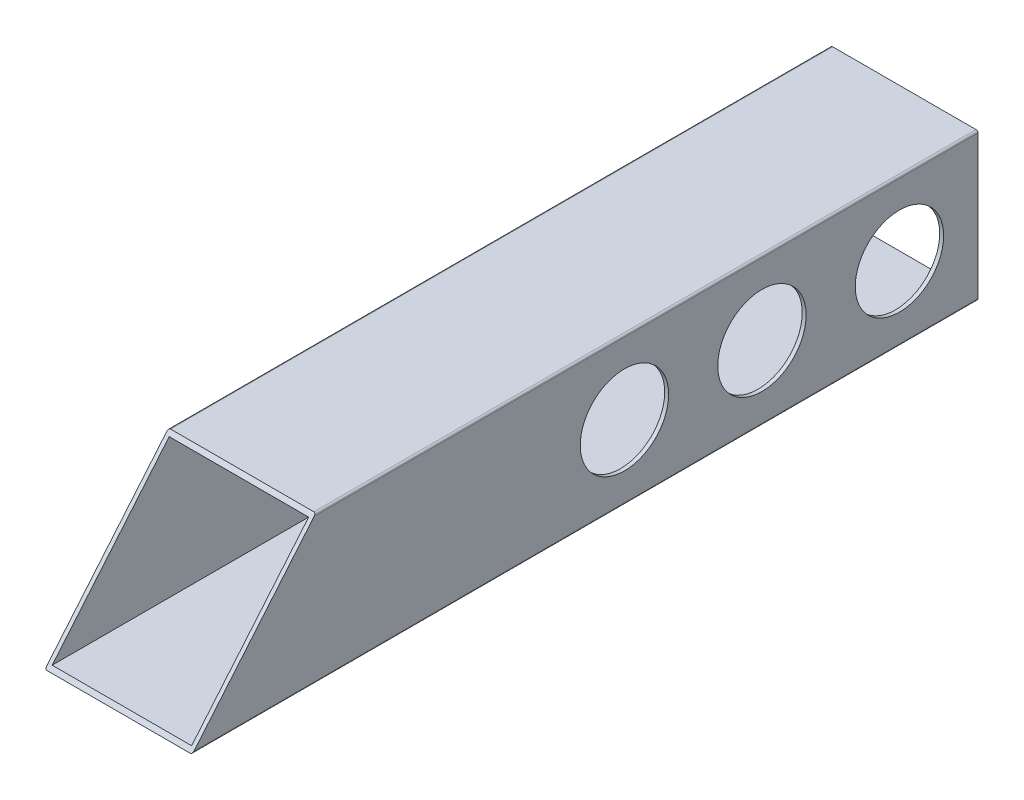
ISO-10303-21;
HEADER;
FILE_DESCRIPTION(('STEP AP214'),'2;1');
FILE_NAME('part.step','',(''),(''),'','','');
FILE_SCHEMA(('AUTOMOTIVE_DESIGN { 1 0 10303 214 1 1 1 1 }'));
ENDSEC;
DATA;
#1=APPLICATION_CONTEXT('core data for automotive mechanical design processes');
#2=APPLICATION_PROTOCOL_DEFINITION('international standard','automotive_design',2000,#1);
#3=PRODUCT_CONTEXT('',#1,'mechanical');
#4=PRODUCT('Part','Part','',(#3));
#5=PRODUCT_RELATED_PRODUCT_CATEGORY('part','',(#4));
#6=PRODUCT_DEFINITION_FORMATION('','',#4);
#7=PRODUCT_DEFINITION_CONTEXT('part definition',#1,'design');
#8=PRODUCT_DEFINITION('design','',#6,#7);
#9=PRODUCT_DEFINITION_SHAPE('','',#8);
#10=(LENGTH_UNIT() NAMED_UNIT(*) SI_UNIT(.MILLI.,.METRE.));
#11=(NAMED_UNIT(*) PLANE_ANGLE_UNIT() SI_UNIT($,.RADIAN.));
#12=(NAMED_UNIT(*) SI_UNIT($,.STERADIAN.) SOLID_ANGLE_UNIT());
#13=UNCERTAINTY_MEASURE_WITH_UNIT(LENGTH_MEASURE(1.E-05),#10,'distance_accuracy_value','');
#14=(GEOMETRIC_REPRESENTATION_CONTEXT(3) GLOBAL_UNCERTAINTY_ASSIGNED_CONTEXT((#13)) GLOBAL_UNIT_ASSIGNED_CONTEXT((#10,
#11,#12)) REPRESENTATION_CONTEXT('',''));
#15=CARTESIAN_POINT('',(0.,0.,0.));
#16=DIRECTION('',(0.,0.,1.));
#17=DIRECTION('',(1.,0.,0.));
#18=AXIS2_PLACEMENT_3D('',#15,#16,#17);
#19=CARTESIAN_POINT('',(148.,1.99999999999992,0.));
#20=DIRECTION('',(0.,0.,-1.));
#21=DIRECTION('',(-1.,0.,0.));
#22=AXIS2_PLACEMENT_3D('',#19,#20,#21);
#23=PLANE('',#22);
#24=CARTESIAN_POINT('',(148.,1.99999999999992,0.));
#25=DIRECTION('',(0.,0.,1.));
#26=DIRECTION('',(-1.,0.,0.));
#27=AXIS2_PLACEMENT_3D('',#24,#25,#26);
#28=CIRCLE('',#27,2.);
#29=CARTESIAN_POINT('',(148.,0.,0.));
#30=VERTEX_POINT('',#29);
#31=CARTESIAN_POINT('',(150.,1.99999999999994,0.));
#32=VERTEX_POINT('',#31);
#33=EDGE_CURVE('E148',#30,#32,#28,.T.);
#34=ORIENTED_EDGE('',*,*,#33,.F.);
#35=DIRECTION('',(1.,0.,0.));
#36=VECTOR('',#35,1.);
#37=CARTESIAN_POINT('',(148.,0.,0.));
#38=LINE('',#37,#36);
#39=CARTESIAN_POINT('',(2.00000000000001,0.,0.));
#40=VERTEX_POINT('',#39);
#41=EDGE_CURVE('E220',#40,#30,#38,.T.);
#42=ORIENTED_EDGE('',*,*,#41,.F.);
#43=CARTESIAN_POINT('',(2.,2.,0.));
#44=DIRECTION('',(0.,0.,1.));
#45=DIRECTION('',(1.,0.,0.));
#46=AXIS2_PLACEMENT_3D('',#43,#44,#45);
#47=CIRCLE('',#46,2.);
#48=CARTESIAN_POINT('',(0.,2.00000000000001,0.));
#49=VERTEX_POINT('',#48);
#50=EDGE_CURVE('E236',#49,#40,#47,.T.);
#51=ORIENTED_EDGE('',*,*,#50,.F.);
#52=DIRECTION('',(0.,-1.,0.));
#53=VECTOR('',#52,1.);
#54=CARTESIAN_POINT('',(0.,2.00000000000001,0.));
#55=LINE('',#54,#53);
#56=CARTESIAN_POINT('',(0.,148.,0.));
#57=VERTEX_POINT('',#56);
#58=EDGE_CURVE('E233',#57,#49,#55,.T.);
#59=ORIENTED_EDGE('',*,*,#58,.F.);
#60=CARTESIAN_POINT('',(2.,148.,0.));
#61=DIRECTION('',(0.,0.,1.));
#62=DIRECTION('',(-1.,0.,0.));
#63=AXIS2_PLACEMENT_3D('',#60,#61,#62);
#64=CIRCLE('',#63,2.);
#65=CARTESIAN_POINT('',(2.00000000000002,150.,0.));
#66=VERTEX_POINT('',#65);
#67=EDGE_CURVE('E230',#66,#57,#64,.T.);
#68=ORIENTED_EDGE('',*,*,#67,.F.);
#69=DIRECTION('',(-1.,0.,0.));
#70=VECTOR('',#69,1.);
#71=CARTESIAN_POINT('',(2.00000000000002,150.,0.));
#72=LINE('',#71,#70);
#73=CARTESIAN_POINT('',(148.,150.,0.));
#74=VERTEX_POINT('',#73);
#75=EDGE_CURVE('E227',#74,#66,#72,.T.);
#76=ORIENTED_EDGE('',*,*,#75,.F.);
#77=CARTESIAN_POINT('',(148.,148.,0.));
#78=DIRECTION('',(0.,0.,1.));
#79=DIRECTION('',(-1.,0.,0.));
#80=AXIS2_PLACEMENT_3D('',#77,#78,#79);
#81=CIRCLE('',#80,2.);
#82=CARTESIAN_POINT('',(150.,148.,0.));
#83=VERTEX_POINT('',#82);
#84=EDGE_CURVE('E224',#83,#74,#81,.T.);
#85=ORIENTED_EDGE('',*,*,#84,.F.);
#86=DIRECTION('',(0.,1.,0.));
#87=VECTOR('',#86,1.);
#88=CARTESIAN_POINT('',(150.,148.,0.));
#89=LINE('',#88,#87);
#90=EDGE_CURVE('E222',#32,#83,#89,.T.);
#91=ORIENTED_EDGE('',*,*,#90,.F.);
#92=EDGE_LOOP('',(#34,#42,#51,#59,#68,#76,#85,#91));
#93=FACE_BOUND('',#92,.T.);
#94=DIRECTION('',(-1.,0.,0.));
#95=VECTOR('',#94,1.);
#96=CARTESIAN_POINT('',(4.,146.,0.));
#97=LINE('',#96,#95);
#98=CARTESIAN_POINT('',(146.,146.,0.));
#99=VERTEX_POINT('',#98);
#100=CARTESIAN_POINT('',(4.,146.,0.));
#101=VERTEX_POINT('',#100);
#102=EDGE_CURVE('E208',#99,#101,#97,.T.);
#103=ORIENTED_EDGE('',*,*,#102,.T.);
#104=DIRECTION('',(0.,-1.,0.));
#105=VECTOR('',#104,1.);
#106=CARTESIAN_POINT('',(4.,3.99999999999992,0.));
#107=LINE('',#106,#105);
#108=CARTESIAN_POINT('',(4.,3.99999999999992,0.));
#109=VERTEX_POINT('',#108);
#110=EDGE_CURVE('E134',#101,#109,#107,.T.);
#111=ORIENTED_EDGE('',*,*,#110,.T.);
#112=DIRECTION('',(1.,0.,0.));
#113=VECTOR('',#112,1.);
#114=CARTESIAN_POINT('',(146.,3.99999999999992,0.));
#115=LINE('',#114,#113);
#116=CARTESIAN_POINT('',(146.,3.99999999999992,0.));
#117=VERTEX_POINT('',#116);
#118=EDGE_CURVE('E202',#109,#117,#115,.T.);
#119=ORIENTED_EDGE('',*,*,#118,.T.);
#120=DIRECTION('',(0.,1.,0.));
#121=VECTOR('',#120,1.);
#122=CARTESIAN_POINT('',(146.,146.,0.));
#123=LINE('',#122,#121);
#124=EDGE_CURVE('E205',#117,#99,#123,.T.);
#125=ORIENTED_EDGE('',*,*,#124,.T.);
#126=EDGE_LOOP('',(#103,#111,#119,#125));
#127=FACE_BOUND('',#126,.T.);
#128=ADVANCED_FACE('F33',(#93,#127),#23,.T.);
#129=CARTESIAN_POINT('',(148.,1.99999999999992,800.));
#130=DIRECTION('',(0.,0.,-1.));
#131=DIRECTION('',(-1.,0.,0.));
#132=AXIS2_PLACEMENT_3D('',#129,#130,#131);
#133=CYLINDRICAL_SURFACE('',#132,2.);
#134=DIRECTION('',(0.,0.,-1.));
#135=VECTOR('',#134,1.);
#136=CARTESIAN_POINT('',(150.,1.99999999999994,800.));
#137=LINE('',#136,#135);
#138=CARTESIAN_POINT('',(150.,1.99999999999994,798.321800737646));
#139=VERTEX_POINT('',#138);
#140=EDGE_CURVE('E42',#139,#32,#137,.T.);
#141=ORIENTED_EDGE('',*,*,#140,.F.);
#142=CARTESIAN_POINT('',(148.,1.99999999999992,798.321800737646));
#143=DIRECTION('',(0.,-0.642787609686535,-0.766044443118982));
#144=DIRECTION('',(0.,0.766044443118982,-0.642787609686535));
#145=AXIS2_PLACEMENT_3D('',#142,#143,#144);
#146=ELLIPSE('',#145,2.61081457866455,2.);
#147=CARTESIAN_POINT('',(148.,0.,800.));
#148=VERTEX_POINT('',#147);
#149=EDGE_CURVE('E123',#139,#148,#146,.T.);
#150=ORIENTED_EDGE('',*,*,#149,.T.);
#151=DIRECTION('',(0.,0.,-1.));
#152=VECTOR('',#151,1.);
#153=CARTESIAN_POINT('',(148.,0.,800.));
#154=LINE('',#153,#152);
#155=EDGE_CURVE('E219',#148,#30,#154,.T.);
#156=ORIENTED_EDGE('',*,*,#155,.T.);
#157=ORIENTED_EDGE('',*,*,#33,.T.);
#158=EDGE_LOOP('',(#141,#150,#156,#157));
#159=FACE_BOUND('',#158,.T.);
#160=ADVANCED_FACE('F35',(#159),#133,.T.);
#161=CARTESIAN_POINT('',(150.,148.,800.));
#162=DIRECTION('',(-1.,0.,0.));
#163=DIRECTION('',(0.,0.,1.));
#164=AXIS2_PLACEMENT_3D('',#161,#162,#163);
#165=PLANE('',#164);
#166=CARTESIAN_POINT('',(150.,74.9999999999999,360.));
#167=DIRECTION('',(1.,0.,0.));
#168=DIRECTION('',(0.,0.,-1.));
#169=AXIS2_PLACEMENT_3D('',#166,#167,#168);
#170=CIRCLE('',#169,45.);
#171=CARTESIAN_POINT('',(150.,74.9999999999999,315.));
#172=VERTEX_POINT('',#171);
#173=EDGE_CURVE('E326',#172,#172,#170,.T.);
#174=ORIENTED_EDGE('',*,*,#173,.F.);
#175=EDGE_LOOP('',(#174));
#176=FACE_BOUND('',#175,.T.);
#177=CARTESIAN_POINT('',(150.,74.9999999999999,220.));
#178=DIRECTION('',(1.,0.,0.));
#179=DIRECTION('',(0.,0.,-1.));
#180=AXIS2_PLACEMENT_3D('',#177,#178,#179);
#181=CIRCLE('',#180,45.);
#182=CARTESIAN_POINT('',(150.,74.9999999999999,175.));
#183=VERTEX_POINT('',#182);
#184=EDGE_CURVE('E167',#183,#183,#181,.T.);
#185=ORIENTED_EDGE('',*,*,#184,.F.);
#186=EDGE_LOOP('',(#185));
#187=FACE_BOUND('',#186,.T.);
#188=CARTESIAN_POINT('',(150.,74.9999999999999,80.));
#189=DIRECTION('',(1.,0.,0.));
#190=DIRECTION('',(0.,0.,-1.));
#191=AXIS2_PLACEMENT_3D('',#188,#189,#190);
#192=CIRCLE('',#191,45.);
#193=CARTESIAN_POINT('',(150.,74.9999999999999,35.));
#194=VERTEX_POINT('',#193);
#195=EDGE_CURVE('E164',#194,#194,#192,.T.);
#196=ORIENTED_EDGE('',*,*,#195,.F.);
#197=EDGE_LOOP('',(#196));
#198=FACE_BOUND('',#197,.T.);
#199=DIRECTION('',(0.,0.,-1.));
#200=VECTOR('',#199,1.);
#201=CARTESIAN_POINT('',(150.,148.,800.));
#202=LINE('',#201,#200);
#203=CARTESIAN_POINT('',(150.,148.,675.813254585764));
#204=VERTEX_POINT('',#203);
#205=EDGE_CURVE('E142',#204,#83,#202,.T.);
#206=ORIENTED_EDGE('',*,*,#205,.F.);
#207=DIRECTION('',(0.,0.766044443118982,-0.642787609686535));
#208=VECTOR('',#207,1.);
#209=CARTESIAN_POINT('',(150.,0.,800.));
#210=LINE('',#209,#208);
#211=EDGE_CURVE('E126',#139,#204,#210,.T.);
#212=ORIENTED_EDGE('',*,*,#211,.F.);
#213=ORIENTED_EDGE('',*,*,#140,.T.);
#214=ORIENTED_EDGE('',*,*,#90,.T.);
#215=EDGE_LOOP('',(#206,#212,#213,#214));
#216=FACE_BOUND('',#215,.T.);
#217=ADVANCED_FACE('F139',(#176,#187,#198,#216),#165,.F.);
#218=CARTESIAN_POINT('',(148.,148.,800.));
#219=DIRECTION('',(0.,0.,-1.));
#220=DIRECTION('',(-1.,0.,0.));
#221=AXIS2_PLACEMENT_3D('',#218,#219,#220);
#222=CYLINDRICAL_SURFACE('',#221,2.);
#223=DIRECTION('',(0.,0.,-1.));
#224=VECTOR('',#223,1.);
#225=CARTESIAN_POINT('',(148.,150.,800.));
#226=LINE('',#225,#224);
#227=CARTESIAN_POINT('',(148.,150.,674.13505532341));
#228=VERTEX_POINT('',#227);
#229=EDGE_CURVE('E150',#228,#74,#226,.T.);
#230=ORIENTED_EDGE('',*,*,#229,.F.);
#231=CARTESIAN_POINT('',(148.,148.,675.813254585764));
#232=DIRECTION('',(0.,-0.642787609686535,-0.766044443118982));
#233=DIRECTION('',(0.,0.766044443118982,-0.642787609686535));
#234=AXIS2_PLACEMENT_3D('',#231,#232,#233);
#235=ELLIPSE('',#234,2.61081457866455,2.);
#236=EDGE_CURVE('E135',#228,#204,#235,.T.);
#237=ORIENTED_EDGE('',*,*,#236,.T.);
#238=ORIENTED_EDGE('',*,*,#205,.T.);
#239=ORIENTED_EDGE('',*,*,#84,.T.);
#240=EDGE_LOOP('',(#230,#237,#238,#239));
#241=FACE_BOUND('',#240,.T.);
#242=ADVANCED_FACE('F256',(#241),#222,.T.);
#243=CARTESIAN_POINT('',(2.00000000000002,150.,800.));
#244=DIRECTION('',(0.,-1.,0.));
#245=DIRECTION('',(1.,0.,0.));
#246=AXIS2_PLACEMENT_3D('',#243,#244,#245);
#247=PLANE('',#246);
#248=DIRECTION('',(0.,0.,-1.));
#249=VECTOR('',#248,1.);
#250=CARTESIAN_POINT('',(2.00000000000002,150.,800.));
#251=LINE('',#250,#249);
#252=CARTESIAN_POINT('',(2.,150.,674.135055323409));
#253=VERTEX_POINT('',#252);
#254=EDGE_CURVE('E247',#253,#66,#251,.T.);
#255=ORIENTED_EDGE('',*,*,#254,.F.);
#256=DIRECTION('',(1.,0.,0.));
#257=VECTOR('',#256,1.);
#258=CARTESIAN_POINT('',(0.,150.,674.13505532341));
#259=LINE('',#258,#257);
#260=EDGE_CURVE('E184',#253,#228,#259,.T.);
#261=ORIENTED_EDGE('',*,*,#260,.T.);
#262=ORIENTED_EDGE('',*,*,#229,.T.);
#263=ORIENTED_EDGE('',*,*,#75,.T.);
#264=EDGE_LOOP('',(#255,#261,#262,#263));
#265=FACE_BOUND('',#264,.T.);
#266=ADVANCED_FACE('F251',(#265),#247,.F.);
#267=CARTESIAN_POINT('',(2.,148.,800.));
#268=DIRECTION('',(0.,0.,-1.));
#269=DIRECTION('',(-1.,0.,0.));
#270=AXIS2_PLACEMENT_3D('',#267,#268,#269);
#271=CYLINDRICAL_SURFACE('',#270,2.);
#272=DIRECTION('',(0.,0.,-1.));
#273=VECTOR('',#272,1.);
#274=CARTESIAN_POINT('',(0.,148.,800.));
#275=LINE('',#274,#273);
#276=CARTESIAN_POINT('',(0.,148.,675.813254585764));
#277=VERTEX_POINT('',#276);
#278=EDGE_CURVE('E245',#277,#57,#275,.T.);
#279=ORIENTED_EDGE('',*,*,#278,.F.);
#280=CARTESIAN_POINT('',(2.,148.,675.813254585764));
#281=DIRECTION('',(0.,-0.642787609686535,-0.766044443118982));
#282=DIRECTION('',(0.,0.766044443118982,-0.642787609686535));
#283=AXIS2_PLACEMENT_3D('',#280,#281,#282);
#284=ELLIPSE('',#283,2.61081457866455,2.);
#285=EDGE_CURVE('E196',#277,#253,#284,.T.);
#286=ORIENTED_EDGE('',*,*,#285,.T.);
#287=ORIENTED_EDGE('',*,*,#254,.T.);
#288=ORIENTED_EDGE('',*,*,#67,.T.);
#289=EDGE_LOOP('',(#279,#286,#287,#288));
#290=FACE_BOUND('',#289,.T.);
#291=ADVANCED_FACE('F263',(#290),#271,.T.);
#292=CARTESIAN_POINT('',(0.,2.00000000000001,800.));
#293=DIRECTION('',(1.,0.,0.));
#294=DIRECTION('',(0.,0.,-1.));
#295=AXIS2_PLACEMENT_3D('',#292,#293,#294);
#296=PLANE('',#295);
#297=CARTESIAN_POINT('',(0.,74.9999999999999,360.));
#298=DIRECTION('',(1.,0.,0.));
#299=DIRECTION('',(0.,0.,-1.));
#300=AXIS2_PLACEMENT_3D('',#297,#298,#299);
#301=CIRCLE('',#300,45.);
#302=CARTESIAN_POINT('',(0.,74.9999999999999,315.));
#303=VERTEX_POINT('',#302);
#304=EDGE_CURVE('E328',#303,#303,#301,.T.);
#305=ORIENTED_EDGE('',*,*,#304,.T.);
#306=EDGE_LOOP('',(#305));
#307=FACE_BOUND('',#306,.T.);
#308=CARTESIAN_POINT('',(0.,74.9999999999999,220.));
#309=DIRECTION('',(1.,0.,0.));
#310=DIRECTION('',(0.,0.,-1.));
#311=AXIS2_PLACEMENT_3D('',#308,#309,#310);
#312=CIRCLE('',#311,45.);
#313=CARTESIAN_POINT('',(0.,74.9999999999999,175.));
#314=VERTEX_POINT('',#313);
#315=EDGE_CURVE('E160',#314,#314,#312,.T.);
#316=ORIENTED_EDGE('',*,*,#315,.T.);
#317=EDGE_LOOP('',(#316));
#318=FACE_BOUND('',#317,.T.);
#319=CARTESIAN_POINT('',(0.,74.9999999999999,80.));
#320=DIRECTION('',(1.,0.,0.));
#321=DIRECTION('',(0.,0.,-1.));
#322=AXIS2_PLACEMENT_3D('',#319,#320,#321);
#323=CIRCLE('',#322,45.);
#324=CARTESIAN_POINT('',(0.,74.9999999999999,35.));
#325=VERTEX_POINT('',#324);
#326=EDGE_CURVE('E156',#325,#325,#323,.T.);
#327=ORIENTED_EDGE('',*,*,#326,.T.);
#328=EDGE_LOOP('',(#327));
#329=FACE_BOUND('',#328,.T.);
#330=DIRECTION('',(0.,0.,-1.));
#331=VECTOR('',#330,1.);
#332=CARTESIAN_POINT('',(0.,2.00000000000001,800.));
#333=LINE('',#332,#331);
#334=CARTESIAN_POINT('',(0.,2.,798.321800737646));
#335=VERTEX_POINT('',#334);
#336=EDGE_CURVE('E243',#335,#49,#333,.T.);
#337=ORIENTED_EDGE('',*,*,#336,.F.);
#338=DIRECTION('',(0.,0.766044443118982,-0.642787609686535));
#339=VECTOR('',#338,1.);
#340=CARTESIAN_POINT('',(0.,0.,800.));
#341=LINE('',#340,#339);
#342=EDGE_CURVE('E143',#335,#277,#341,.T.);
#343=ORIENTED_EDGE('',*,*,#342,.T.);
#344=ORIENTED_EDGE('',*,*,#278,.T.);
#345=ORIENTED_EDGE('',*,*,#58,.T.);
#346=EDGE_LOOP('',(#337,#343,#344,#345));
#347=FACE_BOUND('',#346,.T.);
#348=ADVANCED_FACE('F266',(#307,#318,#329,#347),#296,.F.);
#349=CARTESIAN_POINT('',(2.,2.,800.));
#350=DIRECTION('',(0.,0.,-1.));
#351=DIRECTION('',(-1.,0.,0.));
#352=AXIS2_PLACEMENT_3D('',#349,#350,#351);
#353=CYLINDRICAL_SURFACE('',#352,2.);
#354=DIRECTION('',(0.,0.,-1.));
#355=VECTOR('',#354,1.);
#356=CARTESIAN_POINT('',(2.00000000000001,0.,800.));
#357=LINE('',#356,#355);
#358=CARTESIAN_POINT('',(2.00000000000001,0.,800.));
#359=VERTEX_POINT('',#358);
#360=EDGE_CURVE('E240',#359,#40,#357,.T.);
#361=ORIENTED_EDGE('',*,*,#360,.F.);
#362=CARTESIAN_POINT('',(2.,2.,798.321800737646));
#363=DIRECTION('',(0.,-0.642787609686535,-0.766044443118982));
#364=DIRECTION('',(0.,0.766044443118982,-0.642787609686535));
#365=AXIS2_PLACEMENT_3D('',#362,#363,#364);
#366=ELLIPSE('',#365,2.61081457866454,2.);
#367=EDGE_CURVE('E193',#359,#335,#366,.T.);
#368=ORIENTED_EDGE('',*,*,#367,.T.);
#369=ORIENTED_EDGE('',*,*,#336,.T.);
#370=ORIENTED_EDGE('',*,*,#50,.T.);
#371=EDGE_LOOP('',(#361,#368,#369,#370));
#372=FACE_BOUND('',#371,.T.);
#373=ADVANCED_FACE('F269',(#372),#353,.T.);
#374=CARTESIAN_POINT('',(148.,0.,800.));
#375=DIRECTION('',(0.,1.,0.));
#376=DIRECTION('',(-1.,0.,0.));
#377=AXIS2_PLACEMENT_3D('',#374,#375,#376);
#378=PLANE('',#377);
#379=ORIENTED_EDGE('',*,*,#41,.T.);
#380=ORIENTED_EDGE('',*,*,#155,.F.);
#381=DIRECTION('',(1.,0.,0.));
#382=VECTOR('',#381,1.);
#383=CARTESIAN_POINT('',(148.,0.,800.));
#384=LINE('',#383,#382);
#385=EDGE_CURVE('E129',#359,#148,#384,.T.);
#386=ORIENTED_EDGE('',*,*,#385,.F.);
#387=ORIENTED_EDGE('',*,*,#360,.T.);
#388=EDGE_LOOP('',(#379,#380,#386,#387));
#389=FACE_BOUND('',#388,.T.);
#390=ADVANCED_FACE('F272',(#389),#378,.F.);
#391=CARTESIAN_POINT('',(4.,3.99999999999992,800.));
#392=DIRECTION('',(1.,0.,0.));
#393=DIRECTION('',(0.,0.,-1.));
#394=AXIS2_PLACEMENT_3D('',#391,#392,#393);
#395=PLANE('',#394);
#396=CARTESIAN_POINT('',(4.,74.9999999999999,360.));
#397=DIRECTION('',(1.,0.,0.));
#398=DIRECTION('',(0.,0.,-1.));
#399=AXIS2_PLACEMENT_3D('',#396,#397,#398);
#400=CIRCLE('',#399,45.);
#401=CARTESIAN_POINT('',(4.,74.9999999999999,315.));
#402=VERTEX_POINT('',#401);
#403=EDGE_CURVE('E172',#402,#402,#400,.T.);
#404=ORIENTED_EDGE('',*,*,#403,.F.);
#405=EDGE_LOOP('',(#404));
#406=FACE_BOUND('',#405,.T.);
#407=CARTESIAN_POINT('',(4.,74.9999999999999,220.));
#408=DIRECTION('',(1.,0.,0.));
#409=DIRECTION('',(0.,0.,-1.));
#410=AXIS2_PLACEMENT_3D('',#407,#408,#409);
#411=CIRCLE('',#410,45.);
#412=CARTESIAN_POINT('',(4.,74.9999999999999,175.));
#413=VERTEX_POINT('',#412);
#414=EDGE_CURVE('E159',#413,#413,#411,.T.);
#415=ORIENTED_EDGE('',*,*,#414,.F.);
#416=EDGE_LOOP('',(#415));
#417=FACE_BOUND('',#416,.T.);
#418=CARTESIAN_POINT('',(4.,74.9999999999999,80.));
#419=DIRECTION('',(1.,0.,0.));
#420=DIRECTION('',(0.,0.,-1.));
#421=AXIS2_PLACEMENT_3D('',#418,#419,#420);
#422=CIRCLE('',#421,45.);
#423=CARTESIAN_POINT('',(4.,74.9999999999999,35.));
#424=VERTEX_POINT('',#423);
#425=EDGE_CURVE('E144',#424,#424,#422,.T.);
#426=ORIENTED_EDGE('',*,*,#425,.F.);
#427=EDGE_LOOP('',(#426));
#428=FACE_BOUND('',#427,.T.);
#429=DIRECTION('',(0.,0.766044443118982,-0.642787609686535));
#430=VECTOR('',#429,1.);
#431=CARTESIAN_POINT('',(4.,2.34729635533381,798.030384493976));
#432=LINE('',#431,#430);
#433=CARTESIAN_POINT('',(4.,3.99999999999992,796.643601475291));
#434=VERTEX_POINT('',#433);
#435=CARTESIAN_POINT('',(4.,146.,677.491453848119));
#436=VERTEX_POINT('',#435);
#437=EDGE_CURVE('E49',#434,#436,#432,.T.);
#438=ORIENTED_EDGE('',*,*,#437,.F.);
#439=DIRECTION('',(0.,0.,-1.));
#440=VECTOR('',#439,1.);
#441=CARTESIAN_POINT('',(4.,3.99999999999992,800.));
#442=LINE('',#441,#440);
#443=EDGE_CURVE('E216',#434,#109,#442,.T.);
#444=ORIENTED_EDGE('',*,*,#443,.T.);
#445=ORIENTED_EDGE('',*,*,#110,.F.);
#446=DIRECTION('',(0.,0.,-1.));
#447=VECTOR('',#446,1.);
#448=CARTESIAN_POINT('',(4.,146.,800.));
#449=LINE('',#448,#447);
#450=EDGE_CURVE('E56',#436,#101,#449,.T.);
#451=ORIENTED_EDGE('',*,*,#450,.F.);
#452=EDGE_LOOP('',(#438,#444,#445,#451));
#453=FACE_BOUND('',#452,.T.);
#454=ADVANCED_FACE('F274',(#406,#417,#428,#453),#395,.T.);
#455=CARTESIAN_POINT('',(146.,3.99999999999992,800.));
#456=DIRECTION('',(0.,1.,0.));
#457=DIRECTION('',(0.,0.,1.));
#458=AXIS2_PLACEMENT_3D('',#455,#456,#457);
#459=PLANE('',#458);
#460=DIRECTION('',(-1.,0.,0.));
#461=VECTOR('',#460,1.);
#462=CARTESIAN_POINT('',(146.,3.99999999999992,796.643601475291));
#463=LINE('',#462,#461);
#464=CARTESIAN_POINT('',(146.,3.99999999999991,796.643601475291));
#465=VERTEX_POINT('',#464);
#466=EDGE_CURVE('E190',#465,#434,#463,.T.);
#467=ORIENTED_EDGE('',*,*,#466,.F.);
#468=DIRECTION('',(0.,0.,-1.));
#469=VECTOR('',#468,1.);
#470=CARTESIAN_POINT('',(146.,3.99999999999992,800.));
#471=LINE('',#470,#469);
#472=EDGE_CURVE('E214',#465,#117,#471,.T.);
#473=ORIENTED_EDGE('',*,*,#472,.T.);
#474=ORIENTED_EDGE('',*,*,#118,.F.);
#475=ORIENTED_EDGE('',*,*,#443,.F.);
#476=EDGE_LOOP('',(#467,#473,#474,#475));
#477=FACE_BOUND('',#476,.T.);
#478=ADVANCED_FACE('F280',(#477),#459,.T.);
#479=CARTESIAN_POINT('',(146.,146.,800.));
#480=DIRECTION('',(-1.,0.,0.));
#481=DIRECTION('',(0.,0.,1.));
#482=AXIS2_PLACEMENT_3D('',#479,#480,#481);
#483=PLANE('',#482);
#484=CARTESIAN_POINT('',(146.,74.9999999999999,360.));
#485=DIRECTION('',(-1.,0.,0.));
#486=DIRECTION('',(0.,0.,1.));
#487=AXIS2_PLACEMENT_3D('',#484,#485,#486);
#488=CIRCLE('',#487,45.);
#489=CARTESIAN_POINT('',(146.,74.9999999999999,405.));
#490=VERTEX_POINT('',#489);
#491=EDGE_CURVE('E37',#490,#490,#488,.T.);
#492=ORIENTED_EDGE('',*,*,#491,.F.);
#493=EDGE_LOOP('',(#492));
#494=FACE_BOUND('',#493,.T.);
#495=CARTESIAN_POINT('',(146.,74.9999999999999,220.));
#496=DIRECTION('',(-1.,0.,0.));
#497=DIRECTION('',(0.,0.,1.));
#498=AXIS2_PLACEMENT_3D('',#495,#496,#497);
#499=CIRCLE('',#498,45.);
#500=CARTESIAN_POINT('',(146.,74.9999999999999,265.));
#501=VERTEX_POINT('',#500);
#502=EDGE_CURVE('E157',#501,#501,#499,.T.);
#503=ORIENTED_EDGE('',*,*,#502,.F.);
#504=EDGE_LOOP('',(#503));
#505=FACE_BOUND('',#504,.T.);
#506=CARTESIAN_POINT('',(146.,74.9999999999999,80.));
#507=DIRECTION('',(-1.,0.,0.));
#508=DIRECTION('',(0.,0.,1.));
#509=AXIS2_PLACEMENT_3D('',#506,#507,#508);
#510=CIRCLE('',#509,45.);
#511=CARTESIAN_POINT('',(146.,74.9999999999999,125.));
#512=VERTEX_POINT('',#511);
#513=EDGE_CURVE('E154',#512,#512,#510,.T.);
#514=ORIENTED_EDGE('',*,*,#513,.F.);
#515=EDGE_LOOP('',(#514));
#516=FACE_BOUND('',#515,.T.);
#517=DIRECTION('',(0.,-0.766044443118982,0.642787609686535));
#518=VECTOR('',#517,1.);
#519=CARTESIAN_POINT('',(146.,85.6763169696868,728.109034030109));
#520=LINE('',#519,#518);
#521=CARTESIAN_POINT('',(146.,146.,677.491453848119));
#522=VERTEX_POINT('',#521);
#523=EDGE_CURVE('E188',#522,#465,#520,.T.);
#524=ORIENTED_EDGE('',*,*,#523,.F.);
#525=DIRECTION('',(0.,0.,-1.));
#526=VECTOR('',#525,1.);
#527=CARTESIAN_POINT('',(146.,146.,800.));
#528=LINE('',#527,#526);
#529=EDGE_CURVE('E212',#522,#99,#528,.T.);
#530=ORIENTED_EDGE('',*,*,#529,.T.);
#531=ORIENTED_EDGE('',*,*,#124,.F.);
#532=ORIENTED_EDGE('',*,*,#472,.F.);
#533=EDGE_LOOP('',(#524,#530,#531,#532));
#534=FACE_BOUND('',#533,.T.);
#535=ADVANCED_FACE('F292',(#494,#505,#516,#534),#483,.T.);
#536=CARTESIAN_POINT('',(4.,146.,800.));
#537=DIRECTION('',(0.,-1.,0.));
#538=DIRECTION('',(0.,0.,-1.));
#539=AXIS2_PLACEMENT_3D('',#536,#537,#538);
#540=PLANE('',#539);
#541=DIRECTION('',(1.,0.,0.));
#542=VECTOR('',#541,1.);
#543=CARTESIAN_POINT('',(4.,146.,677.491453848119));
#544=LINE('',#543,#542);
#545=EDGE_CURVE('E11',#436,#522,#544,.T.);
#546=ORIENTED_EDGE('',*,*,#545,.F.);
#547=ORIENTED_EDGE('',*,*,#450,.T.);
#548=ORIENTED_EDGE('',*,*,#102,.F.);
#549=ORIENTED_EDGE('',*,*,#529,.F.);
#550=EDGE_LOOP('',(#546,#547,#548,#549));
#551=FACE_BOUND('',#550,.T.);
#552=ADVANCED_FACE('F296',(#551),#540,.T.);
#553=CARTESIAN_POINT('',(0.,0.,800.));
#554=DIRECTION('',(0.,-0.642787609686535,-0.766044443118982));
#555=DIRECTION('',(0.,0.766044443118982,-0.642787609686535));
#556=AXIS2_PLACEMENT_3D('',#553,#554,#555);
#557=PLANE('',#556);
#558=ORIENTED_EDGE('',*,*,#437,.T.);
#559=ORIENTED_EDGE('',*,*,#545,.T.);
#560=ORIENTED_EDGE('',*,*,#523,.T.);
#561=ORIENTED_EDGE('',*,*,#466,.T.);
#562=EDGE_LOOP('',(#558,#559,#560,#561));
#563=FACE_BOUND('',#562,.T.);
#564=ORIENTED_EDGE('',*,*,#211,.T.);
#565=ORIENTED_EDGE('',*,*,#236,.F.);
#566=ORIENTED_EDGE('',*,*,#260,.F.);
#567=ORIENTED_EDGE('',*,*,#285,.F.);
#568=ORIENTED_EDGE('',*,*,#342,.F.);
#569=ORIENTED_EDGE('',*,*,#367,.F.);
#570=ORIENTED_EDGE('',*,*,#385,.T.);
#571=ORIENTED_EDGE('',*,*,#149,.F.);
#572=EDGE_LOOP('',(#564,#565,#566,#567,#568,#569,#570,#571));
#573=FACE_BOUND('',#572,.T.);
#574=ADVANCED_FACE('F125',(#563,#573),#557,.F.);
#575=CARTESIAN_POINT('',(0.,74.9999999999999,80.));
#576=DIRECTION('',(1.,0.,0.));
#577=DIRECTION('',(0.,0.,-1.));
#578=AXIS2_PLACEMENT_3D('',#575,#576,#577);
#579=CYLINDRICAL_SURFACE('',#578,45.);
#580=ORIENTED_EDGE('',*,*,#513,.T.);
#581=EDGE_LOOP('',(#580));
#582=FACE_BOUND('',#581,.T.);
#583=ORIENTED_EDGE('',*,*,#195,.T.);
#584=EDGE_LOOP('',(#583));
#585=FACE_BOUND('',#584,.T.);
#586=ADVANCED_FACE('F302',(#582,#585),#579,.F.);
#587=ORIENTED_EDGE('',*,*,#425,.T.);
#588=EDGE_LOOP('',(#587));
#589=FACE_BOUND('',#588,.T.);
#590=ORIENTED_EDGE('',*,*,#326,.F.);
#591=EDGE_LOOP('',(#590));
#592=FACE_BOUND('',#591,.T.);
#593=ADVANCED_FACE('F305',(#589,#592),#579,.F.);
#594=CARTESIAN_POINT('',(0.,74.9999999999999,220.));
#595=DIRECTION('',(1.,0.,0.));
#596=DIRECTION('',(0.,0.,-1.));
#597=AXIS2_PLACEMENT_3D('',#594,#595,#596);
#598=CYLINDRICAL_SURFACE('',#597,45.);
#599=ORIENTED_EDGE('',*,*,#502,.T.);
#600=EDGE_LOOP('',(#599));
#601=FACE_BOUND('',#600,.T.);
#602=ORIENTED_EDGE('',*,*,#184,.T.);
#603=EDGE_LOOP('',(#602));
#604=FACE_BOUND('',#603,.T.);
#605=ADVANCED_FACE('F307',(#601,#604),#598,.F.);
#606=ORIENTED_EDGE('',*,*,#414,.T.);
#607=EDGE_LOOP('',(#606));
#608=FACE_BOUND('',#607,.T.);
#609=ORIENTED_EDGE('',*,*,#315,.F.);
#610=EDGE_LOOP('',(#609));
#611=FACE_BOUND('',#610,.T.);
#612=ADVANCED_FACE('F310',(#608,#611),#598,.F.);
#613=CARTESIAN_POINT('',(0.,74.9999999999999,360.));
#614=DIRECTION('',(1.,0.,0.));
#615=DIRECTION('',(0.,0.,-1.));
#616=AXIS2_PLACEMENT_3D('',#613,#614,#615);
#617=CYLINDRICAL_SURFACE('',#616,45.);
#618=ORIENTED_EDGE('',*,*,#491,.T.);
#619=EDGE_LOOP('',(#618));
#620=FACE_BOUND('',#619,.T.);
#621=ORIENTED_EDGE('',*,*,#173,.T.);
#622=EDGE_LOOP('',(#621));
#623=FACE_BOUND('',#622,.T.);
#624=ADVANCED_FACE('F311',(#620,#623),#617,.F.);
#625=ORIENTED_EDGE('',*,*,#403,.T.);
#626=EDGE_LOOP('',(#625));
#627=FACE_BOUND('',#626,.T.);
#628=ORIENTED_EDGE('',*,*,#304,.F.);
#629=EDGE_LOOP('',(#628));
#630=FACE_BOUND('',#629,.T.);
#631=ADVANCED_FACE('F313',(#627,#630),#617,.F.);
#632=CLOSED_SHELL('',(#128,#160,#217,#242,#266,#291,#348,#373,#390,#454,#478,#535,#552,#574,
#586,#593,#605,#612,#624,#631));
#633=MANIFOLD_SOLID_BREP('B2',#632);
#634=ADVANCED_BREP_SHAPE_REPRESENTATION('',(#18,#633),#14);
#635=SHAPE_DEFINITION_REPRESENTATION(#9,#634);
ENDSEC;
END-ISO-10303-21;
